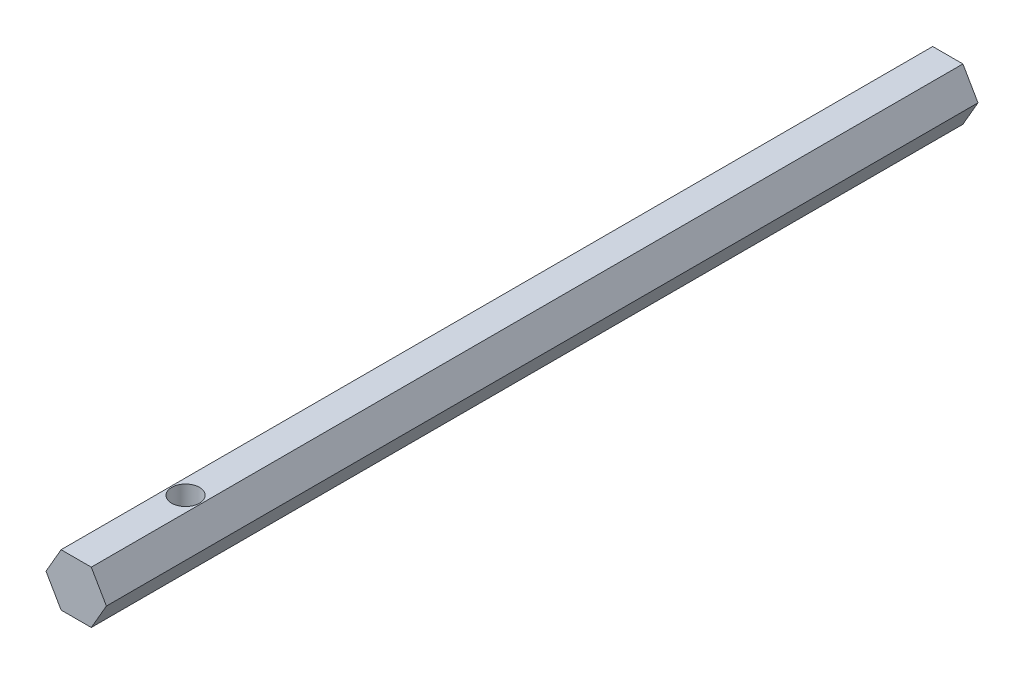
from build123d import *

# Parameters (mm, degrees)
BOSS_EXTRUDE1_DEPTH            = 50
F_1_16_0_0625_DIAMETER_HOLE1_D = 1.5875


with BuildPart() as part:
    # Sketch1 → Boss-Extrude1 (new body)
    with BuildSketch(Plane.XY):
        Polygon((1.732050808, 0), (0.866025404, 1.5), (-0.866025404, 1.5), (-1.732050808, 0), (-0.866025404, -1.5), (0.866025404, -1.5), align=None)
    extrude(amount=BOSS_EXTRUDE1_DEPTH)

    # 1_16 _0.0625_ Diameter Hole1 (through all)
    with Locations(Plane(origin=(0, 1.5, 0), x_dir=(1, 0, 0), z_dir=(0, 1, 0))):
        with Locations((0, -43.7262)):
            Hole(F_1_16_0_0625_DIAMETER_HOLE1_D / 2)


solid = part.part
